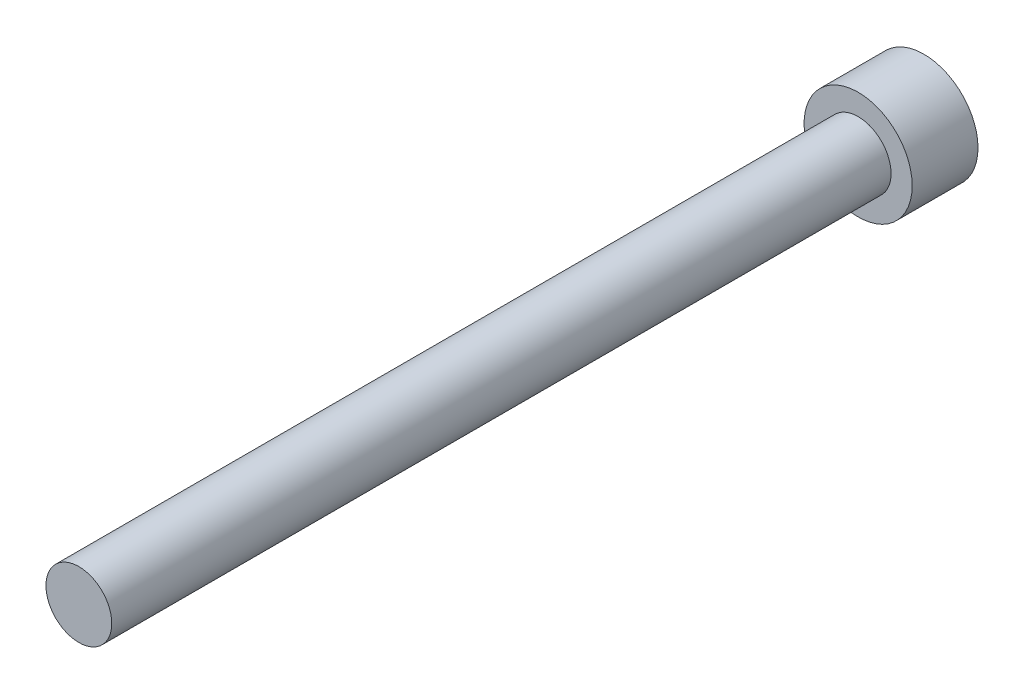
ISO-10303-21;
HEADER;
FILE_DESCRIPTION(('STEP AP214'),'2;1');
FILE_NAME('part.step','',(''),(''),'','','');
FILE_SCHEMA(('AUTOMOTIVE_DESIGN { 1 0 10303 214 1 1 1 1 }'));
ENDSEC;
DATA;
#1=APPLICATION_CONTEXT('core data for automotive mechanical design processes');
#2=APPLICATION_PROTOCOL_DEFINITION('international standard','automotive_design',2000,#1);
#3=PRODUCT_CONTEXT('',#1,'mechanical');
#4=PRODUCT('Part','Part','',(#3));
#5=PRODUCT_RELATED_PRODUCT_CATEGORY('part','',(#4));
#6=PRODUCT_DEFINITION_FORMATION('','',#4);
#7=PRODUCT_DEFINITION_CONTEXT('part definition',#1,'design');
#8=PRODUCT_DEFINITION('design','',#6,#7);
#9=PRODUCT_DEFINITION_SHAPE('','',#8);
#10=(LENGTH_UNIT() NAMED_UNIT(*) SI_UNIT(.MILLI.,.METRE.));
#11=(NAMED_UNIT(*) PLANE_ANGLE_UNIT() SI_UNIT($,.RADIAN.));
#12=(NAMED_UNIT(*) SI_UNIT($,.STERADIAN.) SOLID_ANGLE_UNIT());
#13=UNCERTAINTY_MEASURE_WITH_UNIT(LENGTH_MEASURE(1.E-05),#10,'distance_accuracy_value','');
#14=(GEOMETRIC_REPRESENTATION_CONTEXT(3) GLOBAL_UNCERTAINTY_ASSIGNED_CONTEXT((#13)) GLOBAL_UNIT_ASSIGNED_CONTEXT((#10,
#11,#12)) REPRESENTATION_CONTEXT('',''));
#15=CARTESIAN_POINT('',(0.,0.,0.));
#16=DIRECTION('',(0.,0.,1.));
#17=DIRECTION('',(1.,0.,0.));
#18=AXIS2_PLACEMENT_3D('',#15,#16,#17);
#19=CARTESIAN_POINT('',(0.,0.,57.15));
#20=DIRECTION('',(0.,0.,1.));
#21=DIRECTION('',(1.,0.,0.));
#22=AXIS2_PLACEMENT_3D('',#19,#20,#21);
#23=PLANE('',#22);
#24=CARTESIAN_POINT('',(0.,0.,57.15));
#25=DIRECTION('',(0.,0.,1.));
#26=DIRECTION('',(1.,0.,0.));
#27=AXIS2_PLACEMENT_3D('',#24,#25,#26);
#28=CIRCLE('',#27,2.413);
#29=CARTESIAN_POINT('',(2.413,0.,57.15));
#30=VERTEX_POINT('',#29);
#31=EDGE_CURVE('E11',#30,#30,#28,.T.);
#32=ORIENTED_EDGE('',*,*,#31,.T.);
#33=EDGE_LOOP('',(#32));
#34=FACE_BOUND('',#33,.T.);
#35=ADVANCED_FACE('F37',(#34),#23,.T.);
#36=CARTESIAN_POINT('',(0.,0.,57.15));
#37=DIRECTION('',(0.,0.,1.));
#38=DIRECTION('',(1.,0.,0.));
#39=AXIS2_PLACEMENT_3D('',#36,#37,#38);
#40=CYLINDRICAL_SURFACE('',#39,2.413);
#41=CARTESIAN_POINT('',(0.,0.,0.));
#42=DIRECTION('',(0.,0.,1.));
#43=DIRECTION('',(1.,0.,0.));
#44=AXIS2_PLACEMENT_3D('',#41,#42,#43);
#45=CIRCLE('',#44,2.413);
#46=CARTESIAN_POINT('',(2.413,0.,0.));
#47=VERTEX_POINT('',#46);
#48=EDGE_CURVE('E44',#47,#47,#45,.T.);
#49=ORIENTED_EDGE('',*,*,#48,.T.);
#50=EDGE_LOOP('',(#49));
#51=FACE_BOUND('',#50,.T.);
#52=ORIENTED_EDGE('',*,*,#31,.F.);
#53=EDGE_LOOP('',(#52));
#54=FACE_BOUND('',#53,.T.);
#55=ADVANCED_FACE('F151',(#51,#54),#40,.T.);
#56=CARTESIAN_POINT('',(0.,-2.413,0.));
#57=DIRECTION('',(0.,0.,1.));
#58=DIRECTION('',(1.,0.,0.));
#59=AXIS2_PLACEMENT_3D('',#56,#57,#58);
#60=PLANE('',#59);
#61=CARTESIAN_POINT('',(0.,0.,0.));
#62=DIRECTION('',(0.,0.,1.));
#63=DIRECTION('',(1.,0.,0.));
#64=AXIS2_PLACEMENT_3D('',#61,#62,#63);
#65=CIRCLE('',#64,3.9624);
#66=CARTESIAN_POINT('',(3.9624,0.,0.));
#67=VERTEX_POINT('',#66);
#68=EDGE_CURVE('E146',#67,#67,#65,.T.);
#69=ORIENTED_EDGE('',*,*,#68,.T.);
#70=EDGE_LOOP('',(#69));
#71=FACE_BOUND('',#70,.T.);
#72=ORIENTED_EDGE('',*,*,#48,.F.);
#73=EDGE_LOOP('',(#72));
#74=FACE_BOUND('',#73,.T.);
#75=ADVANCED_FACE('F154',(#71,#74),#60,.T.);
#76=CARTESIAN_POINT('',(0.,0.,57.15));
#77=DIRECTION('',(0.,0.,1.));
#78=DIRECTION('',(1.,0.,0.));
#79=AXIS2_PLACEMENT_3D('',#76,#77,#78);
#80=CYLINDRICAL_SURFACE('',#79,3.9624);
#81=CARTESIAN_POINT('',(0.,0.,-4.826));
#82=DIRECTION('',(0.,0.,1.));
#83=DIRECTION('',(1.,0.,0.));
#84=AXIS2_PLACEMENT_3D('',#81,#82,#83);
#85=CIRCLE('',#84,3.9624);
#86=CARTESIAN_POINT('',(3.9624,0.,-4.826));
#87=VERTEX_POINT('',#86);
#88=EDGE_CURVE('E138',#87,#87,#85,.T.);
#89=ORIENTED_EDGE('',*,*,#88,.T.);
#90=EDGE_LOOP('',(#89));
#91=FACE_BOUND('',#90,.T.);
#92=ORIENTED_EDGE('',*,*,#68,.F.);
#93=EDGE_LOOP('',(#92));
#94=FACE_BOUND('',#93,.T.);
#95=ADVANCED_FACE('F156',(#91,#94),#80,.T.);
#96=CARTESIAN_POINT('',(0.,-3.9624,-4.826));
#97=DIRECTION('',(0.,0.,-1.));
#98=DIRECTION('',(-1.,0.,0.));
#99=AXIS2_PLACEMENT_3D('',#96,#97,#98);
#100=PLANE('',#99);
#101=DIRECTION('',(0.866025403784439,-0.5,0.));
#102=VECTOR('',#101,1.);
#103=CARTESIAN_POINT('',(0.,2.28769270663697,-4.826));
#104=LINE('',#103,#102);
#105=CARTESIAN_POINT('',(0.,2.28769270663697,-4.826));
#106=VERTEX_POINT('',#105);
#107=CARTESIAN_POINT('',(1.9812,1.14384635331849,-4.826));
#108=VERTEX_POINT('',#107);
#109=EDGE_CURVE('E51',#106,#108,#104,.T.);
#110=ORIENTED_EDGE('',*,*,#109,.F.);
#111=DIRECTION('',(0.866025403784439,0.5,0.));
#112=VECTOR('',#111,1.);
#113=CARTESIAN_POINT('',(-1.9812,1.14384635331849,-4.826));
#114=LINE('',#113,#112);
#115=CARTESIAN_POINT('',(-1.9812,1.14384635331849,-4.826));
#116=VERTEX_POINT('',#115);
#117=EDGE_CURVE('E134',#116,#106,#114,.T.);
#118=ORIENTED_EDGE('',*,*,#117,.F.);
#119=DIRECTION('',(0.,1.,0.));
#120=VECTOR('',#119,1.);
#121=CARTESIAN_POINT('',(-1.9812,-1.14384635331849,-4.826));
#122=LINE('',#121,#120);
#123=CARTESIAN_POINT('',(-1.9812,-1.14384635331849,-4.826));
#124=VERTEX_POINT('',#123);
#125=EDGE_CURVE('E132',#124,#116,#122,.T.);
#126=ORIENTED_EDGE('',*,*,#125,.F.);
#127=DIRECTION('',(-0.866025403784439,0.5,0.));
#128=VECTOR('',#127,1.);
#129=CARTESIAN_POINT('',(0.,-2.28769270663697,-4.826));
#130=LINE('',#129,#128);
#131=CARTESIAN_POINT('',(0.,-2.28769270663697,-4.826));
#132=VERTEX_POINT('',#131);
#133=EDGE_CURVE('E99',#132,#124,#130,.T.);
#134=ORIENTED_EDGE('',*,*,#133,.F.);
#135=DIRECTION('',(-0.866025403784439,-0.5,0.));
#136=VECTOR('',#135,1.);
#137=CARTESIAN_POINT('',(1.9812,-1.14384635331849,-4.826));
#138=LINE('',#137,#136);
#139=CARTESIAN_POINT('',(1.9812,-1.14384635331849,-4.826));
#140=VERTEX_POINT('',#139);
#141=EDGE_CURVE('E128',#140,#132,#138,.T.);
#142=ORIENTED_EDGE('',*,*,#141,.F.);
#143=DIRECTION('',(0.,-1.,0.));
#144=VECTOR('',#143,1.);
#145=CARTESIAN_POINT('',(1.9812,1.14384635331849,-4.826));
#146=LINE('',#145,#144);
#147=EDGE_CURVE('E125',#108,#140,#146,.T.);
#148=ORIENTED_EDGE('',*,*,#147,.F.);
#149=EDGE_LOOP('',(#110,#118,#126,#134,#142,#148));
#150=FACE_BOUND('',#149,.T.);
#151=ORIENTED_EDGE('',*,*,#88,.F.);
#152=EDGE_LOOP('',(#151));
#153=FACE_BOUND('',#152,.T.);
#154=ADVANCED_FACE('F163',(#150,#153),#100,.T.);
#155=CARTESIAN_POINT('',(0.,2.28769270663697,-1.778));
#156=DIRECTION('',(0.5,0.866025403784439,0.));
#157=DIRECTION('',(-0.866025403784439,0.5,0.));
#158=AXIS2_PLACEMENT_3D('',#155,#156,#157);
#159=PLANE('',#158);
#160=ORIENTED_EDGE('',*,*,#109,.T.);
#161=DIRECTION('',(0.,0.,-1.));
#162=VECTOR('',#161,1.);
#163=CARTESIAN_POINT('',(1.9812,1.14384635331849,-1.778));
#164=LINE('',#163,#162);
#165=CARTESIAN_POINT('',(1.9812,1.14384635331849,-1.778));
#166=VERTEX_POINT('',#165);
#167=EDGE_CURVE('E81',#166,#108,#164,.T.);
#168=ORIENTED_EDGE('',*,*,#167,.F.);
#169=DIRECTION('',(0.866025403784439,-0.5,0.));
#170=VECTOR('',#169,1.);
#171=CARTESIAN_POINT('',(0.,2.28769270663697,-1.778));
#172=LINE('',#171,#170);
#173=CARTESIAN_POINT('',(0.,2.28769270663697,-1.778));
#174=VERTEX_POINT('',#173);
#175=EDGE_CURVE('E136',#174,#166,#172,.T.);
#176=ORIENTED_EDGE('',*,*,#175,.F.);
#177=DIRECTION('',(0.,0.,-1.));
#178=VECTOR('',#177,1.);
#179=CARTESIAN_POINT('',(0.,2.28769270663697,-1.778));
#180=LINE('',#179,#178);
#181=EDGE_CURVE('E59',#174,#106,#180,.T.);
#182=ORIENTED_EDGE('',*,*,#181,.T.);
#183=EDGE_LOOP('',(#160,#168,#176,#182));
#184=FACE_BOUND('',#183,.T.);
#185=ADVANCED_FACE('F197',(#184),#159,.F.);
#186=CARTESIAN_POINT('',(-1.9812,1.14384635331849,-1.778));
#187=DIRECTION('',(-0.5,0.866025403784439,0.));
#188=DIRECTION('',(-0.866025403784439,-0.5,0.));
#189=AXIS2_PLACEMENT_3D('',#186,#187,#188);
#190=PLANE('',#189);
#191=ORIENTED_EDGE('',*,*,#117,.T.);
#192=ORIENTED_EDGE('',*,*,#181,.F.);
#193=DIRECTION('',(0.866025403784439,0.5,0.));
#194=VECTOR('',#193,1.);
#195=CARTESIAN_POINT('',(-1.9812,1.14384635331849,-1.778));
#196=LINE('',#195,#194);
#197=CARTESIAN_POINT('',(-1.9812,1.14384635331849,-1.778));
#198=VERTEX_POINT('',#197);
#199=EDGE_CURVE('E111',#198,#174,#196,.T.);
#200=ORIENTED_EDGE('',*,*,#199,.F.);
#201=DIRECTION('',(0.,0.,-1.));
#202=VECTOR('',#201,1.);
#203=CARTESIAN_POINT('',(-1.9812,1.14384635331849,-1.778));
#204=LINE('',#203,#202);
#205=EDGE_CURVE('E103',#198,#116,#204,.T.);
#206=ORIENTED_EDGE('',*,*,#205,.T.);
#207=EDGE_LOOP('',(#191,#192,#200,#206));
#208=FACE_BOUND('',#207,.T.);
#209=ADVANCED_FACE('F208',(#208),#190,.F.);
#210=CARTESIAN_POINT('',(-1.9812,-1.14384635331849,-1.778));
#211=DIRECTION('',(-1.,0.,0.));
#212=DIRECTION('',(0.,-1.,0.));
#213=AXIS2_PLACEMENT_3D('',#210,#211,#212);
#214=PLANE('',#213);
#215=ORIENTED_EDGE('',*,*,#125,.T.);
#216=ORIENTED_EDGE('',*,*,#205,.F.);
#217=DIRECTION('',(0.,1.,0.));
#218=VECTOR('',#217,1.);
#219=CARTESIAN_POINT('',(-1.9812,-1.14384635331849,-1.778));
#220=LINE('',#219,#218);
#221=CARTESIAN_POINT('',(-1.9812,-1.14384635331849,-1.778));
#222=VERTEX_POINT('',#221);
#223=EDGE_CURVE('E107',#222,#198,#220,.T.);
#224=ORIENTED_EDGE('',*,*,#223,.F.);
#225=DIRECTION('',(0.,0.,-1.));
#226=VECTOR('',#225,1.);
#227=CARTESIAN_POINT('',(-1.9812,-1.14384635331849,-1.778));
#228=LINE('',#227,#226);
#229=EDGE_CURVE('E92',#222,#124,#228,.T.);
#230=ORIENTED_EDGE('',*,*,#229,.T.);
#231=EDGE_LOOP('',(#215,#216,#224,#230));
#232=FACE_BOUND('',#231,.T.);
#233=ADVANCED_FACE('F108',(#232),#214,.F.);
#234=CARTESIAN_POINT('',(0.,-2.28769270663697,-1.778));
#235=DIRECTION('',(-0.5,-0.866025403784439,0.));
#236=DIRECTION('',(0.866025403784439,-0.5,0.));
#237=AXIS2_PLACEMENT_3D('',#234,#235,#236);
#238=PLANE('',#237);
#239=ORIENTED_EDGE('',*,*,#133,.T.);
#240=ORIENTED_EDGE('',*,*,#229,.F.);
#241=DIRECTION('',(-0.866025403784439,0.5,0.));
#242=VECTOR('',#241,1.);
#243=CARTESIAN_POINT('',(0.,-2.28769270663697,-1.778));
#244=LINE('',#243,#242);
#245=CARTESIAN_POINT('',(0.,-2.28769270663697,-1.778));
#246=VERTEX_POINT('',#245);
#247=EDGE_CURVE('E96',#246,#222,#244,.T.);
#248=ORIENTED_EDGE('',*,*,#247,.F.);
#249=DIRECTION('',(0.,0.,-1.));
#250=VECTOR('',#249,1.);
#251=CARTESIAN_POINT('',(0.,-2.28769270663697,-1.778));
#252=LINE('',#251,#250);
#253=EDGE_CURVE('E104',#246,#132,#252,.T.);
#254=ORIENTED_EDGE('',*,*,#253,.T.);
#255=EDGE_LOOP('',(#239,#240,#248,#254));
#256=FACE_BOUND('',#255,.T.);
#257=ADVANCED_FACE('F94',(#256),#238,.F.);
#258=CARTESIAN_POINT('',(1.9812,-1.14384635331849,-1.778));
#259=DIRECTION('',(0.5,-0.866025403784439,0.));
#260=DIRECTION('',(0.866025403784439,0.5,0.));
#261=AXIS2_PLACEMENT_3D('',#258,#259,#260);
#262=PLANE('',#261);
#263=ORIENTED_EDGE('',*,*,#141,.T.);
#264=ORIENTED_EDGE('',*,*,#253,.F.);
#265=DIRECTION('',(-0.866025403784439,-0.5,0.));
#266=VECTOR('',#265,1.);
#267=CARTESIAN_POINT('',(1.9812,-1.14384635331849,-1.778));
#268=LINE('',#267,#266);
#269=CARTESIAN_POINT('',(1.9812,-1.14384635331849,-1.778));
#270=VERTEX_POINT('',#269);
#271=EDGE_CURVE('E117',#270,#246,#268,.T.);
#272=ORIENTED_EDGE('',*,*,#271,.F.);
#273=DIRECTION('',(0.,0.,-1.));
#274=VECTOR('',#273,1.);
#275=CARTESIAN_POINT('',(1.9812,-1.14384635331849,-1.778));
#276=LINE('',#275,#274);
#277=EDGE_CURVE('E141',#270,#140,#276,.T.);
#278=ORIENTED_EDGE('',*,*,#277,.T.);
#279=EDGE_LOOP('',(#263,#264,#272,#278));
#280=FACE_BOUND('',#279,.T.);
#281=ADVANCED_FACE('F236',(#280),#262,.F.);
#282=CARTESIAN_POINT('',(1.9812,1.14384635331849,-1.778));
#283=DIRECTION('',(1.,0.,0.));
#284=DIRECTION('',(0.,0.,-1.));
#285=AXIS2_PLACEMENT_3D('',#282,#283,#284);
#286=PLANE('',#285);
#287=ORIENTED_EDGE('',*,*,#147,.T.);
#288=ORIENTED_EDGE('',*,*,#277,.F.);
#289=DIRECTION('',(0.,-1.,0.));
#290=VECTOR('',#289,1.);
#291=CARTESIAN_POINT('',(1.9812,1.14384635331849,-1.778));
#292=LINE('',#291,#290);
#293=EDGE_CURVE('E119',#166,#270,#292,.T.);
#294=ORIENTED_EDGE('',*,*,#293,.F.);
#295=ORIENTED_EDGE('',*,*,#167,.T.);
#296=EDGE_LOOP('',(#287,#288,#294,#295));
#297=FACE_BOUND('',#296,.T.);
#298=ADVANCED_FACE('F246',(#297),#286,.F.);
#299=CARTESIAN_POINT('',(3.9624,0.,-1.778));
#300=DIRECTION('',(0.,0.,-1.));
#301=DIRECTION('',(-1.,0.,0.));
#302=AXIS2_PLACEMENT_3D('',#299,#300,#301);
#303=PLANE('',#302);
#304=ORIENTED_EDGE('',*,*,#175,.T.);
#305=ORIENTED_EDGE('',*,*,#293,.T.);
#306=ORIENTED_EDGE('',*,*,#271,.T.);
#307=ORIENTED_EDGE('',*,*,#247,.T.);
#308=ORIENTED_EDGE('',*,*,#223,.T.);
#309=ORIENTED_EDGE('',*,*,#199,.T.);
#310=EDGE_LOOP('',(#304,#305,#306,#307,#308,#309));
#311=FACE_BOUND('',#310,.T.);
#312=ADVANCED_FACE('F114',(#311),#303,.T.);
#313=CLOSED_SHELL('',(#35,#55,#75,#95,#154,#185,#209,#233,#257,#281,#298,#312));
#314=MANIFOLD_SOLID_BREP('B2',#313);
#315=ADVANCED_BREP_SHAPE_REPRESENTATION('',(#18,#314),#14);
#316=SHAPE_DEFINITION_REPRESENTATION(#9,#315);
ENDSEC;
END-ISO-10303-21;
